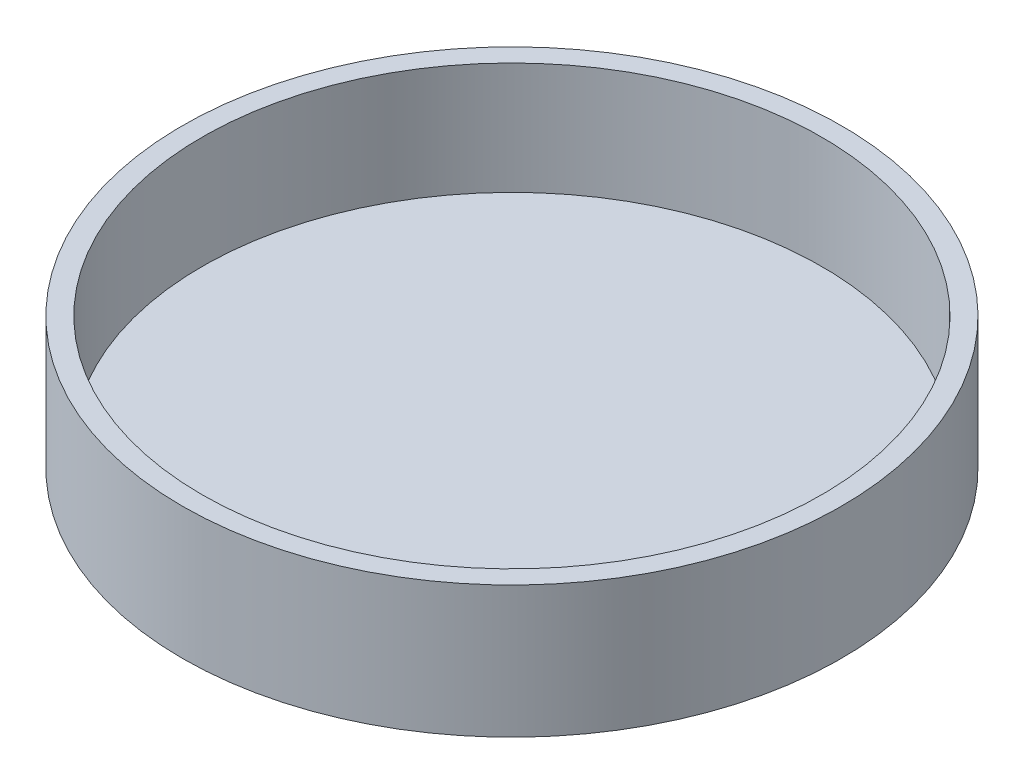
from build123d import *

# Parameters (mm, degrees)
SKETCH1_R           = 25
BOSS_EXTRUDE1_DEPTH = 10
SHELL1_T            = -1.5


with BuildPart() as part:
    # Sketch1 → Boss-Extrude1 (new body)
    with BuildSketch(Plane(origin=(0, 0, 0), x_dir=(1, 0, 0), z_dir=(0, 1, 0))):
        with Locations(Location((0, 0, 0), (0, 0, 270))):
            Circle(SKETCH1_R)
    extrude(amount=BOSS_EXTRUDE1_DEPTH)

    # Shell1
    shell1_openings = [part.faces().sort_by_distance(p)[0] for p in [
        (0, 10, 0),
    ]]
    offset(amount=SHELL1_T, openings=shell1_openings, kind=Kind.INTERSECTION)


solid = part.part
